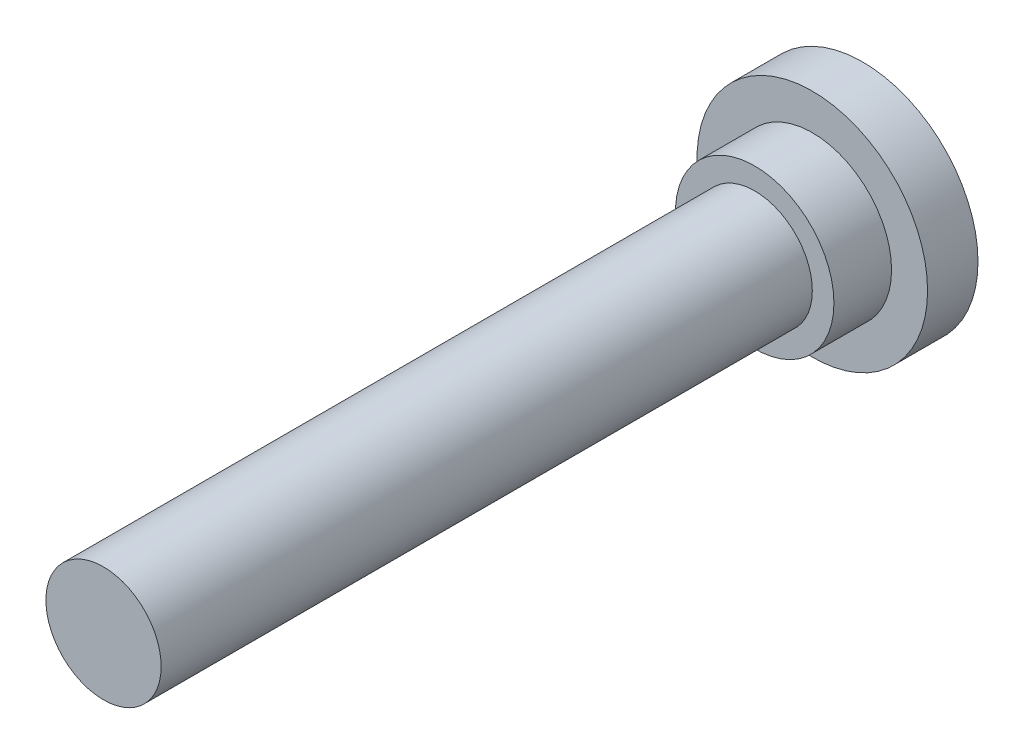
ISO-10303-21;
HEADER;
FILE_DESCRIPTION(('STEP AP214'),'2;1');
FILE_NAME('part.step','',(''),(''),'','','');
FILE_SCHEMA(('AUTOMOTIVE_DESIGN { 1 0 10303 214 1 1 1 1 }'));
ENDSEC;
DATA;
#1=APPLICATION_CONTEXT('core data for automotive mechanical design processes');
#2=APPLICATION_PROTOCOL_DEFINITION('international standard','automotive_design',2000,#1);
#3=PRODUCT_CONTEXT('',#1,'mechanical');
#4=PRODUCT('Part','Part','',(#3));
#5=PRODUCT_RELATED_PRODUCT_CATEGORY('part','',(#4));
#6=PRODUCT_DEFINITION_FORMATION('','',#4);
#7=PRODUCT_DEFINITION_CONTEXT('part definition',#1,'design');
#8=PRODUCT_DEFINITION('design','',#6,#7);
#9=PRODUCT_DEFINITION_SHAPE('','',#8);
#10=(LENGTH_UNIT() NAMED_UNIT(*) SI_UNIT(.MILLI.,.METRE.));
#11=(NAMED_UNIT(*) PLANE_ANGLE_UNIT() SI_UNIT($,.RADIAN.));
#12=(NAMED_UNIT(*) SI_UNIT($,.STERADIAN.) SOLID_ANGLE_UNIT());
#13=UNCERTAINTY_MEASURE_WITH_UNIT(LENGTH_MEASURE(1.E-05),#10,'distance_accuracy_value','');
#14=(GEOMETRIC_REPRESENTATION_CONTEXT(3) GLOBAL_UNCERTAINTY_ASSIGNED_CONTEXT((#13)) GLOBAL_UNIT_ASSIGNED_CONTEXT((#10,
#11,#12)) REPRESENTATION_CONTEXT('',''));
#15=CARTESIAN_POINT('',(0.,0.,0.));
#16=DIRECTION('',(0.,0.,1.));
#17=DIRECTION('',(1.,0.,0.));
#18=AXIS2_PLACEMENT_3D('',#15,#16,#17);
#19=CARTESIAN_POINT('',(0.,0.,105.4));
#20=DIRECTION('',(0.,0.,1.));
#21=DIRECTION('',(1.,0.,0.));
#22=AXIS2_PLACEMENT_3D('',#19,#20,#21);
#23=PLANE('',#22);
#24=CARTESIAN_POINT('',(0.,0.,105.4));
#25=DIRECTION('',(0.,0.,1.));
#26=DIRECTION('',(1.,0.,0.));
#27=AXIS2_PLACEMENT_3D('',#24,#25,#26);
#28=CIRCLE('',#27,8.);
#29=CARTESIAN_POINT('',(8.,0.,105.4));
#30=VERTEX_POINT('',#29);
#31=EDGE_CURVE('E8',#30,#30,#28,.T.);
#32=ORIENTED_EDGE('',*,*,#31,.T.);
#33=EDGE_LOOP('',(#32));
#34=FACE_BOUND('',#33,.T.);
#35=ADVANCED_FACE('F12',(#34),#23,.T.);
#36=CARTESIAN_POINT('',(0.,0.,30.));
#37=DIRECTION('',(0.,0.,1.));
#38=DIRECTION('',(1.,0.,0.));
#39=AXIS2_PLACEMENT_3D('',#36,#37,#38);
#40=CYLINDRICAL_SURFACE('',#39,8.);
#41=CARTESIAN_POINT('',(0.,0.,15.));
#42=DIRECTION('',(0.,0.,1.));
#43=DIRECTION('',(1.,0.,0.));
#44=AXIS2_PLACEMENT_3D('',#41,#42,#43);
#45=CIRCLE('',#44,8.);
#46=CARTESIAN_POINT('',(8.,0.,15.));
#47=VERTEX_POINT('',#46);
#48=EDGE_CURVE('E18',#47,#47,#45,.T.);
#49=ORIENTED_EDGE('',*,*,#48,.T.);
#50=EDGE_LOOP('',(#49));
#51=FACE_BOUND('',#50,.T.);
#52=ORIENTED_EDGE('',*,*,#31,.F.);
#53=EDGE_LOOP('',(#52));
#54=FACE_BOUND('',#53,.T.);
#55=ADVANCED_FACE('F52',(#51,#54),#40,.T.);
#56=CARTESIAN_POINT('',(-8.,0.,15.));
#57=DIRECTION('',(0.,0.,1.));
#58=DIRECTION('',(1.,0.,0.));
#59=AXIS2_PLACEMENT_3D('',#56,#57,#58);
#60=PLANE('',#59);
#61=CARTESIAN_POINT('',(0.,0.,15.));
#62=DIRECTION('',(0.,0.,1.));
#63=DIRECTION('',(1.,0.,0.));
#64=AXIS2_PLACEMENT_3D('',#61,#62,#63);
#65=CIRCLE('',#64,11.);
#66=CARTESIAN_POINT('',(11.,0.,15.));
#67=VERTEX_POINT('',#66);
#68=EDGE_CURVE('E22',#67,#67,#65,.T.);
#69=ORIENTED_EDGE('',*,*,#68,.T.);
#70=EDGE_LOOP('',(#69));
#71=FACE_BOUND('',#70,.T.);
#72=ORIENTED_EDGE('',*,*,#48,.F.);
#73=EDGE_LOOP('',(#72));
#74=FACE_BOUND('',#73,.T.);
#75=ADVANCED_FACE('F57',(#71,#74),#60,.T.);
#76=CARTESIAN_POINT('',(0.,0.,30.));
#77=DIRECTION('',(0.,0.,1.));
#78=DIRECTION('',(1.,0.,0.));
#79=AXIS2_PLACEMENT_3D('',#76,#77,#78);
#80=CYLINDRICAL_SURFACE('',#79,11.);
#81=CARTESIAN_POINT('',(0.,0.,7.));
#82=DIRECTION('',(0.,0.,1.));
#83=DIRECTION('',(1.,0.,0.));
#84=AXIS2_PLACEMENT_3D('',#81,#82,#83);
#85=CIRCLE('',#84,11.);
#86=CARTESIAN_POINT('',(11.,0.,7.));
#87=VERTEX_POINT('',#86);
#88=EDGE_CURVE('E26',#87,#87,#85,.T.);
#89=ORIENTED_EDGE('',*,*,#88,.T.);
#90=EDGE_LOOP('',(#89));
#91=FACE_BOUND('',#90,.T.);
#92=ORIENTED_EDGE('',*,*,#68,.F.);
#93=EDGE_LOOP('',(#92));
#94=FACE_BOUND('',#93,.T.);
#95=ADVANCED_FACE('F62',(#91,#94),#80,.T.);
#96=CARTESIAN_POINT('',(-11.,0.,7.));
#97=DIRECTION('',(0.,0.,1.));
#98=DIRECTION('',(1.,0.,0.));
#99=AXIS2_PLACEMENT_3D('',#96,#97,#98);
#100=PLANE('',#99);
#101=CARTESIAN_POINT('',(0.,0.,7.));
#102=DIRECTION('',(0.,0.,1.));
#103=DIRECTION('',(1.,0.,0.));
#104=AXIS2_PLACEMENT_3D('',#101,#102,#103);
#105=CIRCLE('',#104,16.);
#106=CARTESIAN_POINT('',(16.,0.,7.));
#107=VERTEX_POINT('',#106);
#108=EDGE_CURVE('E31',#107,#107,#105,.T.);
#109=ORIENTED_EDGE('',*,*,#108,.T.);
#110=EDGE_LOOP('',(#109));
#111=FACE_BOUND('',#110,.T.);
#112=ORIENTED_EDGE('',*,*,#88,.F.);
#113=EDGE_LOOP('',(#112));
#114=FACE_BOUND('',#113,.T.);
#115=ADVANCED_FACE('F49',(#111,#114),#100,.T.);
#116=CARTESIAN_POINT('',(0.,0.,30.));
#117=DIRECTION('',(0.,0.,1.));
#118=DIRECTION('',(1.,0.,0.));
#119=AXIS2_PLACEMENT_3D('',#116,#117,#118);
#120=CYLINDRICAL_SURFACE('',#119,16.);
#121=CARTESIAN_POINT('',(0.,0.,0.));
#122=DIRECTION('',(0.,0.,1.));
#123=DIRECTION('',(1.,0.,0.));
#124=AXIS2_PLACEMENT_3D('',#121,#122,#123);
#125=CIRCLE('',#124,16.);
#126=CARTESIAN_POINT('',(16.,0.,0.));
#127=VERTEX_POINT('',#126);
#128=EDGE_CURVE('E34',#127,#127,#125,.T.);
#129=ORIENTED_EDGE('',*,*,#128,.T.);
#130=EDGE_LOOP('',(#129));
#131=FACE_BOUND('',#130,.T.);
#132=ORIENTED_EDGE('',*,*,#108,.F.);
#133=EDGE_LOOP('',(#132));
#134=FACE_BOUND('',#133,.T.);
#135=ADVANCED_FACE('F38',(#131,#134),#120,.T.);
#136=CARTESIAN_POINT('',(-16.,0.,0.));
#137=DIRECTION('',(0.,0.,-1.));
#138=DIRECTION('',(-1.,0.,0.));
#139=AXIS2_PLACEMENT_3D('',#136,#137,#138);
#140=PLANE('',#139);
#141=ORIENTED_EDGE('',*,*,#128,.F.);
#142=EDGE_LOOP('',(#141));
#143=FACE_BOUND('',#142,.T.);
#144=ADVANCED_FACE('F41',(#143),#140,.T.);
#145=CLOSED_SHELL('',(#35,#55,#75,#95,#115,#135,#144));
#146=MANIFOLD_SOLID_BREP('B1',#145);
#147=ADVANCED_BREP_SHAPE_REPRESENTATION('',(#18,#146),#14);
#148=SHAPE_DEFINITION_REPRESENTATION(#9,#147);
ENDSEC;
END-ISO-10303-21;
